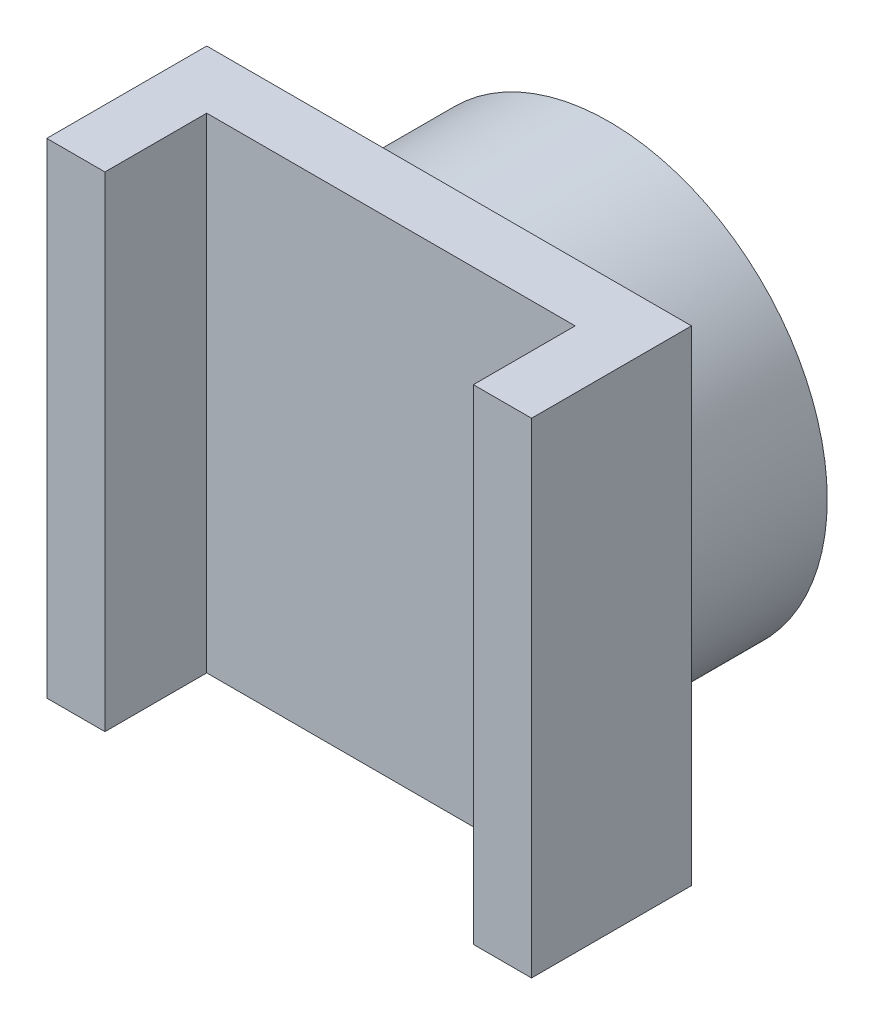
ISO-10303-21;
HEADER;
FILE_DESCRIPTION(('STEP AP214'),'2;1');
FILE_NAME('part.step','',(''),(''),'','','');
FILE_SCHEMA(('AUTOMOTIVE_DESIGN { 1 0 10303 214 1 1 1 1 }'));
ENDSEC;
DATA;
#1=APPLICATION_CONTEXT('core data for automotive mechanical design processes');
#2=APPLICATION_PROTOCOL_DEFINITION('international standard','automotive_design',2000,#1);
#3=PRODUCT_CONTEXT('',#1,'mechanical');
#4=PRODUCT('Part','Part','',(#3));
#5=PRODUCT_RELATED_PRODUCT_CATEGORY('part','',(#4));
#6=PRODUCT_DEFINITION_FORMATION('','',#4);
#7=PRODUCT_DEFINITION_CONTEXT('part definition',#1,'design');
#8=PRODUCT_DEFINITION('design','',#6,#7);
#9=PRODUCT_DEFINITION_SHAPE('','',#8);
#10=(LENGTH_UNIT() NAMED_UNIT(*) SI_UNIT(.MILLI.,.METRE.));
#11=(NAMED_UNIT(*) PLANE_ANGLE_UNIT() SI_UNIT($,.RADIAN.));
#12=(NAMED_UNIT(*) SI_UNIT($,.STERADIAN.) SOLID_ANGLE_UNIT());
#13=UNCERTAINTY_MEASURE_WITH_UNIT(LENGTH_MEASURE(1.E-05),#10,'distance_accuracy_value','');
#14=(GEOMETRIC_REPRESENTATION_CONTEXT(3) GLOBAL_UNCERTAINTY_ASSIGNED_CONTEXT((#13)) GLOBAL_UNIT_ASSIGNED_CONTEXT((#10,
#11,#12)) REPRESENTATION_CONTEXT('',''));
#15=CARTESIAN_POINT('',(0.,0.,0.));
#16=DIRECTION('',(0.,0.,1.));
#17=DIRECTION('',(1.,0.,0.));
#18=AXIS2_PLACEMENT_3D('',#15,#16,#17);
#19=CARTESIAN_POINT('',(10.2,0.,25.2720779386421));
#20=DIRECTION('',(0.,0.,1.));
#21=DIRECTION('',(1.,0.,0.));
#22=AXIS2_PLACEMENT_3D('',#19,#20,#21);
#23=CYLINDRICAL_SURFACE('',#22,4.5);
#24=CARTESIAN_POINT('',(10.2,0.,38.));
#25=DIRECTION('',(0.,0.,1.));
#26=DIRECTION('',(1.,0.,0.));
#27=AXIS2_PLACEMENT_3D('',#24,#25,#26);
#28=CIRCLE('',#27,4.5);
#29=CARTESIAN_POINT('',(14.7,0.,38.));
#30=VERTEX_POINT('',#29);
#31=EDGE_CURVE('E133',#30,#30,#28,.F.);
#32=ORIENTED_EDGE('',*,*,#31,.F.);
#33=EDGE_LOOP('',(#32));
#34=FACE_BOUND('',#33,.T.);
#35=CARTESIAN_POINT('',(10.2,0.,41.3));
#36=DIRECTION('',(0.,0.,1.));
#37=DIRECTION('',(1.,0.,0.));
#38=AXIS2_PLACEMENT_3D('',#35,#36,#37);
#39=CIRCLE('',#38,4.5);
#40=CARTESIAN_POINT('',(14.7,0.,41.3));
#41=VERTEX_POINT('',#40);
#42=EDGE_CURVE('E11',#41,#41,#39,.T.);
#43=ORIENTED_EDGE('',*,*,#42,.F.);
#44=EDGE_LOOP('',(#43));
#45=FACE_BOUND('',#44,.T.);
#46=ADVANCED_FACE('F35',(#34,#45),#23,.T.);
#47=CARTESIAN_POINT('',(10.2,-5.00000000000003,41.3));
#48=DIRECTION('',(0.,0.,1.));
#49=DIRECTION('',(1.,0.,0.));
#50=AXIS2_PLACEMENT_3D('',#47,#48,#49);
#51=PLANE('',#50);
#52=ORIENTED_EDGE('',*,*,#42,.T.);
#53=EDGE_LOOP('',(#52));
#54=FACE_BOUND('',#53,.T.);
#55=DIRECTION('',(1.,0.,0.));
#56=VECTOR('',#55,1.);
#57=CARTESIAN_POINT('',(10.2,4.99999999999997,41.3));
#58=LINE('',#57,#56);
#59=CARTESIAN_POINT('',(5.20000000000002,4.99999999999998,41.3));
#60=VERTEX_POINT('',#59);
#61=CARTESIAN_POINT('',(15.2,4.99999999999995,41.3));
#62=VERTEX_POINT('',#61);
#63=EDGE_CURVE('E87',#60,#62,#58,.T.);
#64=ORIENTED_EDGE('',*,*,#63,.T.);
#65=DIRECTION('',(0.,1.,0.));
#66=VECTOR('',#65,1.);
#67=CARTESIAN_POINT('',(15.2,-5.00000000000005,41.3));
#68=LINE('',#67,#66);
#69=CARTESIAN_POINT('',(15.2,-5.00000000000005,41.3));
#70=VERTEX_POINT('',#69);
#71=EDGE_CURVE('E43',#70,#62,#68,.T.);
#72=ORIENTED_EDGE('',*,*,#71,.F.);
#73=DIRECTION('',(1.,0.,0.));
#74=VECTOR('',#73,1.);
#75=CARTESIAN_POINT('',(5.19999999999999,-5.00000000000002,41.3));
#76=LINE('',#75,#74);
#77=CARTESIAN_POINT('',(5.19999999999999,-5.00000000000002,41.3));
#78=VERTEX_POINT('',#77);
#79=EDGE_CURVE('E93',#78,#70,#76,.T.);
#80=ORIENTED_EDGE('',*,*,#79,.F.);
#81=DIRECTION('',(0.,1.,0.));
#82=VECTOR('',#81,1.);
#83=CARTESIAN_POINT('',(5.19999999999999,-5.00000000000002,41.3));
#84=LINE('',#83,#82);
#85=EDGE_CURVE('E127',#78,#60,#84,.T.);
#86=ORIENTED_EDGE('',*,*,#85,.T.);
#87=EDGE_LOOP('',(#64,#72,#80,#86));
#88=FACE_BOUND('',#87,.T.);
#89=ADVANCED_FACE('F204',(#54,#88),#51,.F.);
#90=CARTESIAN_POINT('',(15.2,-5.00000000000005,41.3));
#91=DIRECTION('',(-1.,0.,0.));
#92=DIRECTION('',(0.,-1.,0.));
#93=AXIS2_PLACEMENT_3D('',#90,#91,#92);
#94=PLANE('',#93);
#95=DIRECTION('',(0.,0.,1.));
#96=VECTOR('',#95,1.);
#97=CARTESIAN_POINT('',(15.2,4.99999999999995,41.3));
#98=LINE('',#97,#96);
#99=CARTESIAN_POINT('',(15.2,4.99999999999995,44.6));
#100=VERTEX_POINT('',#99);
#101=EDGE_CURVE('E132',#62,#100,#98,.T.);
#102=ORIENTED_EDGE('',*,*,#101,.T.);
#103=DIRECTION('',(0.,1.,0.));
#104=VECTOR('',#103,1.);
#105=CARTESIAN_POINT('',(15.2,-5.00000000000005,44.6));
#106=LINE('',#105,#104);
#107=CARTESIAN_POINT('',(15.2,-5.00000000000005,44.6));
#108=VERTEX_POINT('',#107);
#109=EDGE_CURVE('E155',#108,#100,#106,.T.);
#110=ORIENTED_EDGE('',*,*,#109,.F.);
#111=DIRECTION('',(0.,0.,1.));
#112=VECTOR('',#111,1.);
#113=CARTESIAN_POINT('',(15.2,-5.00000000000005,41.3));
#114=LINE('',#113,#112);
#115=EDGE_CURVE('E162',#70,#108,#114,.T.);
#116=ORIENTED_EDGE('',*,*,#115,.F.);
#117=ORIENTED_EDGE('',*,*,#71,.T.);
#118=EDGE_LOOP('',(#102,#110,#116,#117));
#119=FACE_BOUND('',#118,.T.);
#120=ADVANCED_FACE('F160',(#119),#94,.F.);
#121=CARTESIAN_POINT('',(15.2,-5.00000000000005,44.6));
#122=DIRECTION('',(0.,0.,-1.));
#123=DIRECTION('',(-1.,0.,0.));
#124=AXIS2_PLACEMENT_3D('',#121,#122,#123);
#125=PLANE('',#124);
#126=DIRECTION('',(-1.,0.,0.));
#127=VECTOR('',#126,1.);
#128=CARTESIAN_POINT('',(15.2,4.99999999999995,44.6));
#129=LINE('',#128,#127);
#130=CARTESIAN_POINT('',(14.,4.99999999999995,44.6));
#131=VERTEX_POINT('',#130);
#132=EDGE_CURVE('E135',#100,#131,#129,.T.);
#133=ORIENTED_EDGE('',*,*,#132,.T.);
#134=DIRECTION('',(0.,1.,0.));
#135=VECTOR('',#134,1.);
#136=CARTESIAN_POINT('',(14.,-5.00000000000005,44.6));
#137=LINE('',#136,#135);
#138=CARTESIAN_POINT('',(14.,-5.00000000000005,44.6));
#139=VERTEX_POINT('',#138);
#140=EDGE_CURVE('E152',#139,#131,#137,.T.);
#141=ORIENTED_EDGE('',*,*,#140,.F.);
#142=DIRECTION('',(-1.,0.,0.));
#143=VECTOR('',#142,1.);
#144=CARTESIAN_POINT('',(15.2,-5.00000000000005,44.6));
#145=LINE('',#144,#143);
#146=EDGE_CURVE('E177',#108,#139,#145,.T.);
#147=ORIENTED_EDGE('',*,*,#146,.F.);
#148=ORIENTED_EDGE('',*,*,#109,.T.);
#149=EDGE_LOOP('',(#133,#141,#147,#148));
#150=FACE_BOUND('',#149,.T.);
#151=ADVANCED_FACE('F170',(#150),#125,.F.);
#152=CARTESIAN_POINT('',(14.,-5.00000000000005,44.6));
#153=DIRECTION('',(1.,0.,0.));
#154=DIRECTION('',(0.,1.,0.));
#155=AXIS2_PLACEMENT_3D('',#152,#153,#154);
#156=PLANE('',#155);
#157=DIRECTION('',(0.,0.,-1.));
#158=VECTOR('',#157,1.);
#159=CARTESIAN_POINT('',(14.,4.99999999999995,44.6));
#160=LINE('',#159,#158);
#161=CARTESIAN_POINT('',(14.,4.99999999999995,42.5));
#162=VERTEX_POINT('',#161);
#163=EDGE_CURVE('E137',#131,#162,#160,.T.);
#164=ORIENTED_EDGE('',*,*,#163,.T.);
#165=DIRECTION('',(0.,1.,0.));
#166=VECTOR('',#165,1.);
#167=CARTESIAN_POINT('',(14.,-5.00000000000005,42.5));
#168=LINE('',#167,#166);
#169=CARTESIAN_POINT('',(14.,-5.00000000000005,42.5));
#170=VERTEX_POINT('',#169);
#171=EDGE_CURVE('E149',#170,#162,#168,.T.);
#172=ORIENTED_EDGE('',*,*,#171,.F.);
#173=DIRECTION('',(0.,0.,-1.));
#174=VECTOR('',#173,1.);
#175=CARTESIAN_POINT('',(14.,-5.00000000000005,44.6));
#176=LINE('',#175,#174);
#177=EDGE_CURVE('E176',#139,#170,#176,.T.);
#178=ORIENTED_EDGE('',*,*,#177,.F.);
#179=ORIENTED_EDGE('',*,*,#140,.T.);
#180=EDGE_LOOP('',(#164,#172,#178,#179));
#181=FACE_BOUND('',#180,.T.);
#182=ADVANCED_FACE('F174',(#181),#156,.F.);
#183=CARTESIAN_POINT('',(14.,-5.00000000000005,42.5));
#184=DIRECTION('',(0.,0.,-1.));
#185=DIRECTION('',(-1.,0.,0.));
#186=AXIS2_PLACEMENT_3D('',#183,#184,#185);
#187=PLANE('',#186);
#188=DIRECTION('',(-1.,0.,0.));
#189=VECTOR('',#188,1.);
#190=CARTESIAN_POINT('',(14.,4.99999999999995,42.5));
#191=LINE('',#190,#189);
#192=CARTESIAN_POINT('',(6.40000000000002,4.99999999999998,42.5));
#193=VERTEX_POINT('',#192);
#194=EDGE_CURVE('E139',#162,#193,#191,.T.);
#195=ORIENTED_EDGE('',*,*,#194,.T.);
#196=DIRECTION('',(0.,1.,0.));
#197=VECTOR('',#196,1.);
#198=CARTESIAN_POINT('',(6.39999999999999,-5.00000000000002,42.5));
#199=LINE('',#198,#197);
#200=CARTESIAN_POINT('',(6.39999999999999,-5.00000000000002,42.5));
#201=VERTEX_POINT('',#200);
#202=EDGE_CURVE('E122',#201,#193,#199,.T.);
#203=ORIENTED_EDGE('',*,*,#202,.F.);
#204=DIRECTION('',(-1.,0.,0.));
#205=VECTOR('',#204,1.);
#206=CARTESIAN_POINT('',(14.,-5.00000000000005,42.5));
#207=LINE('',#206,#205);
#208=EDGE_CURVE('E113',#170,#201,#207,.T.);
#209=ORIENTED_EDGE('',*,*,#208,.F.);
#210=ORIENTED_EDGE('',*,*,#171,.T.);
#211=EDGE_LOOP('',(#195,#203,#209,#210));
#212=FACE_BOUND('',#211,.T.);
#213=ADVANCED_FACE('F211',(#212),#187,.F.);
#214=CARTESIAN_POINT('',(6.39999999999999,-5.00000000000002,42.5));
#215=DIRECTION('',(-1.,0.,0.));
#216=DIRECTION('',(0.,-1.,0.));
#217=AXIS2_PLACEMENT_3D('',#214,#215,#216);
#218=PLANE('',#217);
#219=DIRECTION('',(0.,0.,1.));
#220=VECTOR('',#219,1.);
#221=CARTESIAN_POINT('',(6.40000000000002,4.99999999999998,42.5));
#222=LINE('',#221,#220);
#223=CARTESIAN_POINT('',(6.40000000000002,4.99999999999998,44.6));
#224=VERTEX_POINT('',#223);
#225=EDGE_CURVE('E121',#193,#224,#222,.T.);
#226=ORIENTED_EDGE('',*,*,#225,.T.);
#227=DIRECTION('',(0.,1.,0.));
#228=VECTOR('',#227,1.);
#229=CARTESIAN_POINT('',(6.39999999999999,-5.00000000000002,44.6));
#230=LINE('',#229,#228);
#231=CARTESIAN_POINT('',(6.39999999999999,-5.00000000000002,44.6));
#232=VERTEX_POINT('',#231);
#233=EDGE_CURVE('E118',#232,#224,#230,.T.);
#234=ORIENTED_EDGE('',*,*,#233,.F.);
#235=DIRECTION('',(0.,0.,1.));
#236=VECTOR('',#235,1.);
#237=CARTESIAN_POINT('',(6.39999999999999,-5.00000000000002,42.5));
#238=LINE('',#237,#236);
#239=EDGE_CURVE('E107',#201,#232,#238,.T.);
#240=ORIENTED_EDGE('',*,*,#239,.F.);
#241=ORIENTED_EDGE('',*,*,#202,.T.);
#242=EDGE_LOOP('',(#226,#234,#240,#241));
#243=FACE_BOUND('',#242,.T.);
#244=ADVANCED_FACE('F119',(#243),#218,.F.);
#245=CARTESIAN_POINT('',(6.39999999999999,-5.00000000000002,44.6));
#246=DIRECTION('',(0.,0.,-1.));
#247=DIRECTION('',(-1.,0.,0.));
#248=AXIS2_PLACEMENT_3D('',#245,#246,#247);
#249=PLANE('',#248);
#250=DIRECTION('',(-1.,0.,0.));
#251=VECTOR('',#250,1.);
#252=CARTESIAN_POINT('',(6.40000000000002,4.99999999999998,44.6));
#253=LINE('',#252,#251);
#254=CARTESIAN_POINT('',(5.20000000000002,4.99999999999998,44.6));
#255=VERTEX_POINT('',#254);
#256=EDGE_CURVE('E80',#224,#255,#253,.T.);
#257=ORIENTED_EDGE('',*,*,#256,.T.);
#258=DIRECTION('',(0.,1.,0.));
#259=VECTOR('',#258,1.);
#260=CARTESIAN_POINT('',(5.19999999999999,-5.00000000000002,44.6));
#261=LINE('',#260,#259);
#262=CARTESIAN_POINT('',(5.19999999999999,-5.00000000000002,44.6));
#263=VERTEX_POINT('',#262);
#264=EDGE_CURVE('E123',#263,#255,#261,.T.);
#265=ORIENTED_EDGE('',*,*,#264,.F.);
#266=DIRECTION('',(-1.,0.,0.));
#267=VECTOR('',#266,1.);
#268=CARTESIAN_POINT('',(6.39999999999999,-5.00000000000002,44.6));
#269=LINE('',#268,#267);
#270=EDGE_CURVE('E111',#232,#263,#269,.T.);
#271=ORIENTED_EDGE('',*,*,#270,.F.);
#272=ORIENTED_EDGE('',*,*,#233,.T.);
#273=EDGE_LOOP('',(#257,#265,#271,#272));
#274=FACE_BOUND('',#273,.T.);
#275=ADVANCED_FACE('F125',(#274),#249,.F.);
#276=CARTESIAN_POINT('',(5.19999999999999,-5.00000000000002,44.6));
#277=DIRECTION('',(1.,0.,0.));
#278=DIRECTION('',(0.,1.,0.));
#279=AXIS2_PLACEMENT_3D('',#276,#277,#278);
#280=PLANE('',#279);
#281=DIRECTION('',(0.,0.,-1.));
#282=VECTOR('',#281,1.);
#283=CARTESIAN_POINT('',(5.20000000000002,4.99999999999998,44.6));
#284=LINE('',#283,#282);
#285=EDGE_CURVE('E143',#255,#60,#284,.T.);
#286=ORIENTED_EDGE('',*,*,#285,.T.);
#287=ORIENTED_EDGE('',*,*,#85,.F.);
#288=DIRECTION('',(0.,0.,-1.));
#289=VECTOR('',#288,1.);
#290=CARTESIAN_POINT('',(5.19999999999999,-5.00000000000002,44.6));
#291=LINE('',#290,#289);
#292=EDGE_CURVE('E51',#263,#78,#291,.T.);
#293=ORIENTED_EDGE('',*,*,#292,.F.);
#294=ORIENTED_EDGE('',*,*,#264,.T.);
#295=EDGE_LOOP('',(#286,#287,#293,#294));
#296=FACE_BOUND('',#295,.T.);
#297=ADVANCED_FACE('F209',(#296),#280,.F.);
#298=CARTESIAN_POINT('',(15.2,-5.00000000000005,41.3));
#299=DIRECTION('',(0.,-1.,0.));
#300=DIRECTION('',(1.,0.,0.));
#301=AXIS2_PLACEMENT_3D('',#298,#299,#300);
#302=PLANE('',#301);
#303=ORIENTED_EDGE('',*,*,#79,.T.);
#304=ORIENTED_EDGE('',*,*,#115,.T.);
#305=ORIENTED_EDGE('',*,*,#146,.T.);
#306=ORIENTED_EDGE('',*,*,#177,.T.);
#307=ORIENTED_EDGE('',*,*,#208,.T.);
#308=ORIENTED_EDGE('',*,*,#239,.T.);
#309=ORIENTED_EDGE('',*,*,#270,.T.);
#310=ORIENTED_EDGE('',*,*,#292,.T.);
#311=EDGE_LOOP('',(#303,#304,#305,#306,#307,#308,#309,#310));
#312=FACE_BOUND('',#311,.T.);
#313=ADVANCED_FACE('F109',(#312),#302,.T.);
#314=CARTESIAN_POINT('',(15.2,4.99999999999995,41.3));
#315=DIRECTION('',(0.,-1.,0.));
#316=DIRECTION('',(1.,0.,0.));
#317=AXIS2_PLACEMENT_3D('',#314,#315,#316);
#318=PLANE('',#317);
#319=ORIENTED_EDGE('',*,*,#63,.F.);
#320=ORIENTED_EDGE('',*,*,#285,.F.);
#321=ORIENTED_EDGE('',*,*,#256,.F.);
#322=ORIENTED_EDGE('',*,*,#225,.F.);
#323=ORIENTED_EDGE('',*,*,#194,.F.);
#324=ORIENTED_EDGE('',*,*,#163,.F.);
#325=ORIENTED_EDGE('',*,*,#132,.F.);
#326=ORIENTED_EDGE('',*,*,#101,.F.);
#327=EDGE_LOOP('',(#319,#320,#321,#322,#323,#324,#325,#326));
#328=FACE_BOUND('',#327,.T.);
#329=ADVANCED_FACE('F165',(#328),#318,.F.);
#330=CARTESIAN_POINT('',(3.7,-10.00005,38.));
#331=DIRECTION('',(0.,0.,1.));
#332=DIRECTION('',(1.,0.,0.));
#333=AXIS2_PLACEMENT_3D('',#330,#331,#332);
#334=PLANE('',#333);
#335=CARTESIAN_POINT('',(10.0733071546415,0.,38.));
#336=DIRECTION('',(0.,0.,-1.));
#337=DIRECTION('',(-1.,0.,0.));
#338=AXIS2_PLACEMENT_3D('',#335,#336,#337);
#339=CIRCLE('',#338,2.8);
#340=CARTESIAN_POINT('',(7.2733071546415,0.,38.));
#341=VERTEX_POINT('',#340);
#342=EDGE_CURVE('E188',#341,#341,#339,.T.);
#343=ORIENTED_EDGE('',*,*,#342,.F.);
#344=EDGE_LOOP('',(#343));
#345=FACE_BOUND('',#344,.T.);
#346=ORIENTED_EDGE('',*,*,#31,.T.);
#347=EDGE_LOOP('',(#346));
#348=FACE_BOUND('',#347,.T.);
#349=ADVANCED_FACE('F195',(#345,#348),#334,.F.);
#350=CARTESIAN_POINT('',(10.2,-5.00000000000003,41.3));
#351=DIRECTION('',(0.,0.,1.));
#352=DIRECTION('',(1.,0.,0.));
#353=AXIS2_PLACEMENT_3D('',#350,#351,#352);
#354=PLANE('',#353);
#355=CARTESIAN_POINT('',(10.0733071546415,0.,41.3));
#356=DIRECTION('',(0.,0.,1.));
#357=DIRECTION('',(1.,0.,0.));
#358=AXIS2_PLACEMENT_3D('',#355,#356,#357);
#359=CIRCLE('',#358,2.8);
#360=CARTESIAN_POINT('',(12.8733071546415,0.,41.3));
#361=VERTEX_POINT('',#360);
#362=EDGE_CURVE('E185',#361,#361,#359,.F.);
#363=ORIENTED_EDGE('',*,*,#362,.T.);
#364=EDGE_LOOP('',(#363));
#365=FACE_BOUND('',#364,.T.);
#366=ADVANCED_FACE('F198',(#365),#354,.F.);
#367=CARTESIAN_POINT('',(10.0733071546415,0.,49.2195959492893));
#368=DIRECTION('',(0.,0.,-1.));
#369=DIRECTION('',(-1.,0.,0.));
#370=AXIS2_PLACEMENT_3D('',#367,#368,#369);
#371=CYLINDRICAL_SURFACE('',#370,2.8);
#372=ORIENTED_EDGE('',*,*,#342,.T.);
#373=EDGE_LOOP('',(#372));
#374=FACE_BOUND('',#373,.T.);
#375=ORIENTED_EDGE('',*,*,#362,.F.);
#376=EDGE_LOOP('',(#375));
#377=FACE_BOUND('',#376,.T.);
#378=ADVANCED_FACE('F192',(#374,#377),#371,.F.);
#379=CLOSED_SHELL('',(#46,#89,#120,#151,#182,#213,#244,#275,#297,#313,#329,#349,#366,#378));
#380=MANIFOLD_SOLID_BREP('B2',#379);
#381=ADVANCED_BREP_SHAPE_REPRESENTATION('',(#18,#380),#14);
#382=SHAPE_DEFINITION_REPRESENTATION(#9,#381);
ENDSEC;
END-ISO-10303-21;
